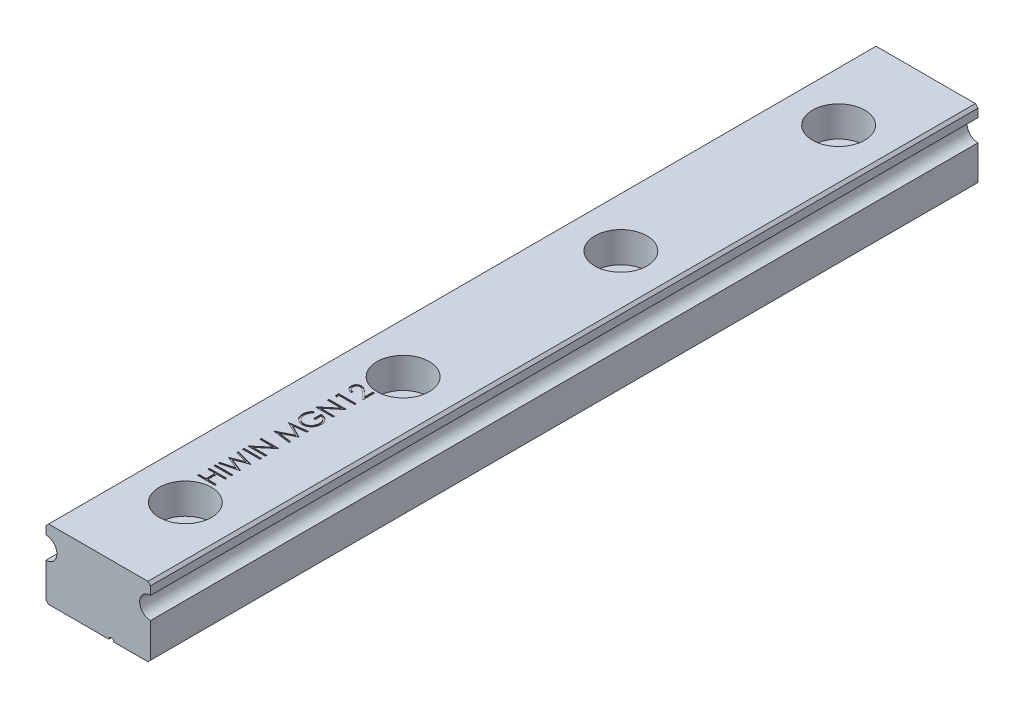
from build123d import *

# Parameters (mm, degrees)
EXTRUDE_1_DEPTH              = 95
HOLE_WIZARD_M3_1_D           = 3.5
HOLE_WIZARD_M3_1_CBORE_D     = 6
HOLE_WIZARD_M3_1_CBORE_DEPTH = 3.5
PATTERN_LINEAR_1_COUNT       = 4
PATTERN_LINEAR_1_PITCH       = 25
SKETCH_6_W                   = 2
SKETCH_6_H                   = 0.17948718
CUT_EXTRUDE_1_DEPTH          = 0.1


with BuildPart() as part:
    # Sketch 1 → Extrude 1 (new body)
    with BuildSketch(Plane.XY):
        with BuildLine():
            Line((-5.7, 0), (1.2, 0))
            ThreePointArc((1.2, 0), (1.5, 0.3), (1.8, 0))
            Line((1.8, 0), (5.7, 0))
            Line((5.7, 0), (6, 0.3))
            Line((6, 0.3), (6, 4.25))
            ThreePointArc((6, 4.25), (4.75, 5.5), (6, 6.75))
            Line((6, 6.75), (6, 7.7))
            Line((6, 7.7), (5.7, 8))
            Line((5.7, 8), (-5.7, 8))
            Line((-5.7, 8), (-6, 7.7))
            Line((-6, 7.7), (-6, 6.75))
            ThreePointArc((-6, 6.75), (-4.75, 5.5), (-6, 4.25))
            Line((-6, 4.25), (-6, 0.3))
            Line((-6, 0.3), (-5.7, 0))
        make_face()
    extrude(amount=-EXTRUDE_1_DEPTH)

    # Hole Wizard M3 _1 (through all)
    with Locations(Plane(origin=(1.750046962, 8, 16.516719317), x_dir=(-1, 0, 0), z_dir=(0, 1, 0))):
        with Locations((1.750046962, -26.516719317)):
            hole_wizard_m3_1 = CounterBoreHole(HOLE_WIZARD_M3_1_D / 2, HOLE_WIZARD_M3_1_CBORE_D / 2, HOLE_WIZARD_M3_1_CBORE_DEPTH)

    # Pattern Linear 1: Hole Wizard M3 _1 ×4
    with Locations(*[(0, 0, -i * PATTERN_LINEAR_1_PITCH) for i in range(1, PATTERN_LINEAR_1_COUNT)]):
        add(hole_wizard_m3_1, mode=Mode.SUBTRACT)

    # Sketch 6 → Cut-Extrude 1 (cut)
    with BuildSketch(Plane(origin=(0, 8, 0), x_dir=(1, 0, 0), z_dir=(0, 1, 0))):
        Polygon((-2, 13.384615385), (-2, 13.564102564), (-1.179487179, 13.564102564), (-1.179487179, 14.58974359), (-2, 14.58974359), (-2, 14.769230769), (0, 14.769230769), (0, 14.58974359), (-0.974358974, 14.58974359), (-0.974358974, 13.564102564), (0, 13.564102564), (0, 13.384615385), align=None)
        with Locations((-1, 15.371794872)):
            Rectangle(SKETCH_6_W, SKETCH_6_H)
        Polygon((-2, 15.769230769), (-2, 15.954727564), (-0.533253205, 16.346153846), (-2, 16.928285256), (-2, 16.954326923), (-0.543269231, 17.525641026), (-2, 17.919070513), (-2, 18.102564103), (0, 17.563301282), (0, 17.537660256), (-1.529647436, 16.935897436), (0, 16.326923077), (0, 16.301282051), align=None)
        with Locations((-1, 18.653846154)):
            Rectangle(SKETCH_6_W, SKETCH_6_H)
        Polygon((0, 19.179487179), (-2, 19.179487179), (-2, 19.217147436), (-0.42588141, 20.538461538), (-2, 20.538461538), (-2, 20.717948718), (0, 20.717948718), (0, 20.677083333), (-1.570512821, 19.358974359), (0, 19.358974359), align=None)
        Polygon((0, 21.897435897), (-2, 22.161458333), (-2, 22.187099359), (-0.358974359, 23.012820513), (-2, 23.836538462), (-2, 23.862580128), (0, 24.128205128), (0, 23.947916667), (-1.439102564, 23.756410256), (0, 23.034455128), (0, 22.993990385), (-1.442307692, 22.269230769), (0, 22.078125), align=None)
        with BuildLine():
            Line((-1.658653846, 26.41025641), (-1.512820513, 26.256410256))
            add(Edge.make_bspline(
                [(-1.512820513, 26.256410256), (-1.539018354, 26.228576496), (-1.590789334, 26.173572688), (-1.657853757, 26.083744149), (-1.715872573, 25.990397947), (-1.762727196, 25.893383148), (-1.799482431, 25.795243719), (-1.826200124, 25.697667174), (-1.843120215, 25.601285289), (-1.845152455, 25.537191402), (-1.846153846, 25.505608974)],
                knots=[0, 0, 0, 0, 1.089067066, 2.152164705, 3.18986567, 4.218445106, 5.218487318, 6.173592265, 7.100032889, 8, 8, 8, 8], degree=3))
            add(Edge.make_bspline(
                [(-1.846153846, 25.505608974), (-1.8459175, 25.486229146), (-1.84544542, 25.447519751), (-1.839420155, 25.390021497), (-1.830754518, 25.333126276), (-1.818216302, 25.276941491), (-1.802325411, 25.221357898), (-1.782448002, 25.166568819), (-1.759273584, 25.112472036), (-1.732495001, 25.059577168), (-1.703078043, 25.008296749), (-1.670478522, 24.959864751), (-1.635743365, 24.91396963), (-1.597995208, 24.871484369), (-1.557604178, 24.83212636), (-1.515297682, 24.795171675), (-1.470243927, 24.761309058), (-1.422628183, 24.731145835), (-1.37355821, 24.70390721), (-1.323450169, 24.68036881), (-1.272769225, 24.659905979), (-1.221133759, 24.644320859), (-1.169076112, 24.631120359), (-1.116323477, 24.621931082), (-1.062738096, 24.616733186), (-1.026853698, 24.615835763), (-1.008814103, 24.615384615)],
                knots=[0, 0, 0, 0, 1.028150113, 2.053633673, 3.06513288, 4.081487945, 5.106702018, 6.131327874, 7.172780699, 8.228344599, 9.276313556, 10.308389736, 11.324843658, 12.329040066, 13.321460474, 14.316307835, 15.308626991, 16.309440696, 17.305625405, 18.28535951, 19.246194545, 20.203493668, 21.145557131, 22.095268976, 23.042464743, 24, 24, 24, 24], degree=3))
            add(Edge.make_bspline(
                [(-1.008814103, 24.615384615), (-0.990373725, 24.615816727), (-0.953543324, 24.61667977), (-0.898573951, 24.622195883), (-0.844427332, 24.632456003), (-0.791018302, 24.646062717), (-0.738240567, 24.663361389), (-0.686149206, 24.684614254), (-0.634749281, 24.709932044), (-0.584551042, 24.739172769), (-0.535693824, 24.771463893), (-0.489286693, 24.806978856), (-0.445869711, 24.845777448), (-0.404808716, 24.887148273), (-0.366362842, 24.93146827), (-0.330995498, 24.979167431), (-0.298159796, 25.029578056), (-0.268216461, 25.082722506), (-0.241469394, 25.138039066), (-0.217684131, 25.194757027), (-0.198095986, 25.253058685), (-0.182131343, 25.312637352), (-0.169045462, 25.373422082), (-0.160626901, 25.435721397), (-0.154517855, 25.49907723), (-0.154071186, 25.54178502), (-0.153846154, 25.563301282)],
                knots=[0, 0, 0, 0, 0.935915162, 1.869274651, 2.799799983, 3.730201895, 4.664668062, 5.616159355, 6.583070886, 7.570012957, 8.562524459, 9.553461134, 10.53281078, 11.515274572, 12.509912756, 13.507571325, 14.526460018, 15.561318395, 16.601025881, 17.643204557, 18.680545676, 19.719612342, 20.772381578, 21.833430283, 22.908478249, 24, 24, 24, 24], degree=3))
            add(Edge.make_bspline(
                [(-0.153846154, 25.563301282), (-0.154387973, 25.589231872), (-0.155451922, 25.640150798), (-0.163740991, 25.714998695), (-0.176670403, 25.78689162), (-0.195664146, 25.855595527), (-0.219705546, 25.921359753), (-0.249436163, 25.983941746), (-0.284543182, 26.043514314), (-0.324315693, 26.099819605), (-0.368629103, 26.151519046), (-0.416020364, 26.198571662), (-0.467103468, 26.239359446), (-0.521117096, 26.27510077), (-0.5785779, 26.304642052), (-0.639166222, 26.32889684), (-0.70291955, 26.347486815), (-0.746971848, 26.355118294), (-0.769230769, 26.358974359)],
                knots=[0, 0, 0, 0, 1.130199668, 2.219330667, 3.279027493, 4.311506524, 5.322739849, 6.327972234, 7.327472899, 8.33386792, 9.329086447, 10.29244429, 11.240784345, 12.174119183, 13.111530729, 14.052100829, 15.015757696, 16, 16, 16, 16], degree=3))
            Line((-0.769230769, 26.358974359), (-0.769230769, 25.692307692))
            Line((-0.769230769, 25.692307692), (-0.974358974, 25.692307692))
            Line((-0.974358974, 25.692307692), (-0.974358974, 26.538461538))
            add(Edge.make_bspline(
                [(-0.974358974, 26.538461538), (-0.936126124, 26.537486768), (-0.861297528, 26.535578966), (-0.752171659, 26.522196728), (-0.64910212, 26.500587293), (-0.551980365, 26.471067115), (-0.460944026, 26.432852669), (-0.375900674, 26.386354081), (-0.297399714, 26.330827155), (-0.224800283, 26.26824976), (-0.160040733, 26.198021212), (-0.103123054, 26.122039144), (-0.055178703, 26.040178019), (-0.01617261, 25.952515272), (0.014269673, 25.859337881), (0.035853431, 25.760430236), (0.048784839, 25.655926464), (0.050437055, 25.584305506), (0.051282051, 25.547676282)],
                knots=[0, 0, 0, 0, 1.140356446, 2.231883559, 3.274166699, 4.278491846, 5.25512956, 6.21435461, 7.1637429, 8.11826594, 9.068280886, 10.0076534, 10.945064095, 11.891975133, 12.864533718, 13.863980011, 14.907571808, 16, 16, 16, 16], degree=3))
            add(Edge.make_bspline(
                [(0.051282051, 25.547676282), (0.050956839, 25.525099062), (0.050315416, 25.480569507), (0.045756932, 25.414803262), (0.03873946, 25.350850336), (0.028142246, 25.288720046), (0.015162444, 25.22818385), (-0.001458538, 25.169544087), (-0.020697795, 25.112577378), (-0.042581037, 25.057195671), (-0.067936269, 25.003901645), (-0.096113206, 24.952457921), (-0.126966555, 24.902580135), (-0.161029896, 24.85460804), (-0.198048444, 24.808291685), (-0.238096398, 24.763929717), (-0.281051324, 24.721273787), (-0.311553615, 24.694553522), (-0.326923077, 24.681089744)],
                knots=[0, 0, 0, 0, 1.107784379, 2.184907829, 3.233506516, 4.263428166, 5.276301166, 6.270063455, 7.25232949, 8.225834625, 9.190232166, 10.146266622, 11.1027726, 12.066435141, 13.031522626, 14.010570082, 14.99756817, 16, 16, 16, 16], degree=3))
            add(Edge.make_bspline(
                [(-0.326923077, 24.681089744), (-0.351306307, 24.661554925), (-0.399668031, 24.622809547), (-0.477153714, 24.572936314), (-0.557383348, 24.530421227), (-0.640580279, 24.495925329), (-0.726666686, 24.468989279), (-0.815532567, 24.449671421), (-0.907292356, 24.43835297), (-0.969386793, 24.436722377), (-1.000801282, 24.435897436)],
                knots=[0, 0, 0, 0, 1.023165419, 2.029347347, 3.013907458, 3.994755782, 4.975994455, 5.96558838, 6.970761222, 8, 8, 8, 8], degree=3))
            add(Edge.make_bspline(
                [(-1.000801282, 24.435897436), (-1.024324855, 24.436201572), (-1.071073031, 24.436805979), (-1.140477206, 24.444134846), (-1.208649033, 24.454649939), (-1.275532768, 24.47010541), (-1.341173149, 24.489588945), (-1.405600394, 24.513905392), (-1.46885351, 24.542216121), (-1.530493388, 24.575124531), (-1.589716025, 24.611735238), (-1.646231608, 24.651511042), (-1.69912419, 24.694758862), (-1.748516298, 24.74160463), (-1.795139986, 24.791104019), (-1.838021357, 24.844296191), (-1.877831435, 24.90037524), (-1.913805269, 24.959775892), (-1.946129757, 25.021560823), (-1.974465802, 25.08559573), (-1.997885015, 25.15185734), (-2.017755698, 25.21985023), (-2.032450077, 25.290088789), (-2.0431065, 25.362063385), (-2.050398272, 25.436149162), (-2.050984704, 25.486226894), (-2.051282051, 25.51161859)],
                knots=[0, 0, 0, 0, 1.00895651, 2.005089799, 2.991467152, 3.967318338, 4.948153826, 5.927364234, 6.919980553, 7.91976625, 8.923240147, 9.905815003, 10.88314567, 11.851989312, 12.825009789, 13.798721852, 14.781296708, 15.773896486, 16.776076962, 17.771600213, 18.775744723, 19.78957137, 20.808953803, 21.851964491, 22.910847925, 24, 24, 24, 24], degree=3))
            add(Edge.make_bspline(
                [(-2.051282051, 25.51161859), (-2.050950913, 25.532326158), (-2.050294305, 25.573386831), (-2.045743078, 25.63448725), (-2.038529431, 25.694643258), (-2.028685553, 25.753944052), (-2.01527773, 25.81218769), (-1.999232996, 25.869540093), (-1.980551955, 25.9260844), (-1.958272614, 25.981643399), (-1.932984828, 26.036590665), (-1.904520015, 26.091231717), (-1.872391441, 26.145379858), (-1.836503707, 26.19912899), (-1.797473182, 26.252818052), (-1.754183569, 26.305597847), (-1.708341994, 26.358742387), (-1.675380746, 26.392914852), (-1.658653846, 26.41025641)],
                knots=[0, 0, 0, 0, 0.985871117, 1.954866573, 2.915460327, 3.869826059, 4.81536089, 5.759505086, 6.70452669, 7.649098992, 8.607881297, 9.583363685, 10.581137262, 11.603961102, 12.659522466, 13.73993555, 14.853081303, 16, 16, 16, 16], degree=3))
        make_face()
        Polygon((0, 26.948717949), (-2, 26.948717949), (-2, 26.986378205), (-0.42588141, 28.307692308), (-2, 28.307692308), (-2, 28.487179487), (0, 28.487179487), (0, 28.446314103), (-1.570512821, 27.128205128), (0, 27.128205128), align=None)
        Polygon((-2, 29.245592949), (-2, 29.615384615), (0, 29.615384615), (0, 29.435897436), (-1.794871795, 29.435897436), (-1.794871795, 29.128205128), align=None)
        with BuildLine():
            Line((-1.384615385, 30.615384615), (-1.384615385, 30.435897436))
            add(Edge.make_bspline(
                [(-1.384615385, 30.435897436), (-1.40842732, 30.437067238), (-1.455193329, 30.439364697), (-1.523378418, 30.450123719), (-1.588552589, 30.465518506), (-1.65019254, 30.487285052), (-1.708843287, 30.51431721), (-1.764271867, 30.546734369), (-1.816266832, 30.585130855), (-1.864346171, 30.62867756), (-1.908453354, 30.675973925), (-1.946542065, 30.727005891), (-1.978723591, 30.78063162), (-2.005627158, 30.83668842), (-2.025821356, 30.895808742), (-2.04080515, 30.957456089), (-2.049820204, 31.02190131), (-2.050789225, 31.065809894), (-2.051282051, 31.088141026)],
                knots=[0, 0, 0, 0, 1.10065271, 2.161652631, 3.183658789, 4.190468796, 5.17591951, 6.163126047, 7.15150782, 8.156236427, 9.156009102, 10.134482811, 11.092018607, 12.041330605, 13.001268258, 13.972401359, 14.968799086, 16, 16, 16, 16], degree=3))
            add(Edge.make_bspline(
                [(-2.051282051, 31.088141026), (-2.050772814, 31.110072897), (-2.049772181, 31.153168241), (-2.041049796, 31.216038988), (-2.02768352, 31.276032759), (-2.007876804, 31.332469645), (-1.983023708, 31.385928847), (-1.952115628, 31.435748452), (-1.916615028, 31.483133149), (-1.87474033, 31.52575738), (-1.830059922, 31.564912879), (-1.782341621, 31.598662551), (-1.732999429, 31.627728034), (-1.681647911, 31.651517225), (-1.628119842, 31.669550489), (-1.572928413, 31.682911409), (-1.515436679, 31.690549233), (-1.476517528, 31.691715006), (-1.456730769, 31.692307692)],
                knots=[0, 0, 0, 0, 1.111674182, 2.184400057, 3.212814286, 4.223731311, 5.211378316, 6.196328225, 7.191884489, 8.207283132, 9.220262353, 10.201199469, 11.166417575, 12.120932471, 13.06540007, 14.026332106, 14.996573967, 16, 16, 16, 16], degree=3))
            add(Edge.make_bspline(
                [(-1.456730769, 31.692307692), (-1.428874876, 31.691340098), (-1.37365192, 31.68942189), (-1.292500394, 31.673013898), (-1.213876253, 31.647386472), (-1.150595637, 31.616533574), (-1.099609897, 31.585400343), (-1.057610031, 31.557372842), (-1.012399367, 31.524375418), (-0.963794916, 31.486689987), (-0.912433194, 31.443667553), (-0.857266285, 31.396425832), (-0.799314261, 31.34374479), (-0.759706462, 31.306802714), (-0.739182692, 31.287660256)],
                knots=[0, 0, 0, 0, 1.184416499, 2.348048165, 3.509039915, 4.696071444, 5.333504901, 6.05069495, 6.844171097, 7.714965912, 8.667477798, 9.695072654, 10.805644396, 12, 12, 12, 12], degree=3))
            Line((-0.739182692, 31.287660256), (-0.205128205, 30.787259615))
            Line((-0.205128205, 30.787259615), (-0.205128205, 31.717948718))
            Line((-0.205128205, 31.717948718), (0, 31.717948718))
            Line((0, 31.717948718), (0, 30.358974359))
            Line((0, 30.358974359), (-0.827724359, 31.134615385))
            add(Edge.make_bspline(
                [(-0.827724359, 31.134615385), (-0.847437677, 31.153499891), (-0.885302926, 31.189773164), (-0.940584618, 31.241077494), (-0.99187007, 31.287156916), (-1.039062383, 31.328309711), (-1.082851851, 31.363643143), (-1.121820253, 31.394998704), (-1.157679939, 31.420121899), (-1.199246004, 31.447387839), (-1.249995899, 31.473795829), (-1.31201515, 31.496488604), (-1.375859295, 31.51032566), (-1.419003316, 31.511985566), (-1.440705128, 31.512820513)],
                knots=[0, 0, 0, 0, 1.329631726, 2.553950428, 3.673215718, 4.687767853, 5.603093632, 6.413772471, 7.123043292, 7.734684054, 8.834405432, 9.900288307, 10.943827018, 12, 12, 12, 12], degree=3))
            add(Edge.make_bspline(
                [(-1.440705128, 31.512820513), (-1.454351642, 31.512457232), (-1.481246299, 31.511741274), (-1.520678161, 31.50542259), (-1.558715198, 31.495873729), (-1.595474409, 31.482190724), (-1.63058621, 31.46412973), (-1.664093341, 31.442144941), (-1.696487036, 31.416779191), (-1.726860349, 31.387435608), (-1.754678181, 31.355200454), (-1.779320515, 31.321146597), (-1.799914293, 31.285117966), (-1.816796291, 31.247266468), (-1.830039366, 31.207697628), (-1.839215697, 31.166334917), (-1.844977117, 31.123292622), (-1.845756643, 31.093902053), (-1.846153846, 31.078926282)],
                knots=[0, 0, 0, 0, 0.991446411, 1.95395049, 2.89581595, 3.838931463, 4.798493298, 5.75982156, 6.748411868, 7.785213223, 8.824556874, 9.840280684, 10.836137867, 11.835679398, 12.848801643, 13.863922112, 14.911575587, 16, 16, 16, 16], degree=3))
            add(Edge.make_bspline(
                [(-1.846153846, 31.078926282), (-1.845761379, 31.063281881), (-1.844990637, 31.032558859), (-1.839152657, 30.987546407), (-1.830302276, 30.944309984), (-1.816245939, 30.903494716), (-1.799637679, 30.864216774), (-1.778538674, 30.827314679), (-1.754021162, 30.792175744), (-1.725592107, 30.759377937), (-1.693650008, 30.729423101), (-1.65844761, 30.702733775), (-1.620238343, 30.679567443), (-1.579179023, 30.659326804), (-1.534860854, 30.642896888), (-1.487451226, 30.630340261), (-1.437153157, 30.620405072), (-1.402418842, 30.617085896), (-1.384615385, 30.615384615)],
                knots=[0, 0, 0, 0, 1.030878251, 2.024474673, 2.987898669, 3.934362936, 4.864849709, 5.795128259, 6.730474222, 7.685293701, 8.650606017, 9.611896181, 10.591709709, 11.591680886, 12.625074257, 13.701333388, 14.821793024, 16, 16, 16, 16], degree=3))
        make_face()
    extrude(amount=-CUT_EXTRUDE_1_DEPTH, mode=Mode.SUBTRACT)


solid = part.part
